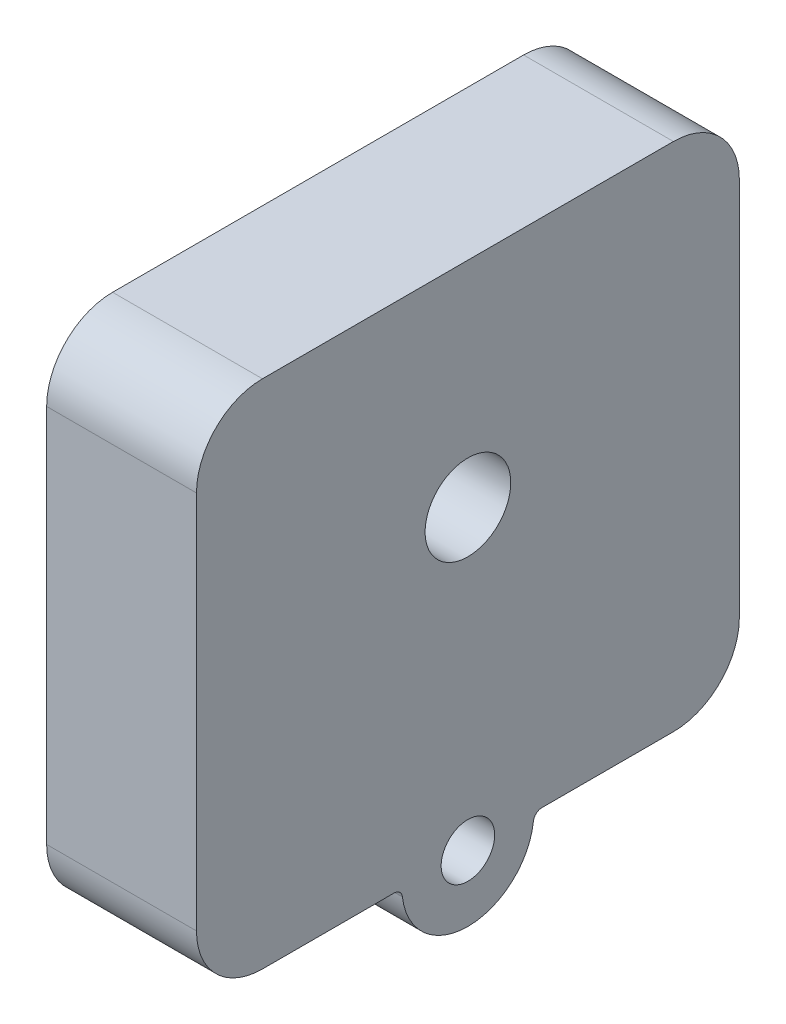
ISO-10303-21;
HEADER;
FILE_DESCRIPTION(('STEP AP214'),'2;1');
FILE_NAME('part.step','',(''),(''),'','','');
FILE_SCHEMA(('AUTOMOTIVE_DESIGN { 1 0 10303 214 1 1 1 1 }'));
ENDSEC;
DATA;
#1=APPLICATION_CONTEXT('core data for automotive mechanical design processes');
#2=APPLICATION_PROTOCOL_DEFINITION('international standard','automotive_design',2000,#1);
#3=PRODUCT_CONTEXT('',#1,'mechanical');
#4=PRODUCT('Part','Part','',(#3));
#5=PRODUCT_RELATED_PRODUCT_CATEGORY('part','',(#4));
#6=PRODUCT_DEFINITION_FORMATION('','',#4);
#7=PRODUCT_DEFINITION_CONTEXT('part definition',#1,'design');
#8=PRODUCT_DEFINITION('design','',#6,#7);
#9=PRODUCT_DEFINITION_SHAPE('','',#8);
#10=(LENGTH_UNIT() NAMED_UNIT(*) SI_UNIT(.MILLI.,.METRE.));
#11=(NAMED_UNIT(*) PLANE_ANGLE_UNIT() SI_UNIT($,.RADIAN.));
#12=(NAMED_UNIT(*) SI_UNIT($,.STERADIAN.) SOLID_ANGLE_UNIT());
#13=UNCERTAINTY_MEASURE_WITH_UNIT(LENGTH_MEASURE(1.E-05),#10,'distance_accuracy_value','');
#14=(GEOMETRIC_REPRESENTATION_CONTEXT(3) GLOBAL_UNCERTAINTY_ASSIGNED_CONTEXT((#13)) GLOBAL_UNIT_ASSIGNED_CONTEXT((#10,
#11,#12)) REPRESENTATION_CONTEXT('',''));
#15=CARTESIAN_POINT('',(0.,0.,0.));
#16=DIRECTION('',(0.,0.,1.));
#17=DIRECTION('',(1.,0.,0.));
#18=AXIS2_PLACEMENT_3D('',#15,#16,#17);
#19=CARTESIAN_POINT('',(0.,-15.6718,4.39030752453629));
#20=DIRECTION('',(1.,0.,0.));
#21=DIRECTION('',(0.,0.,-1.));
#22=AXIS2_PLACEMENT_3D('',#19,#20,#21);
#23=CYLINDRICAL_SURFACE('',#22,0.508);
#24=DIRECTION('',(1.,0.,0.));
#25=VECTOR('',#24,1.);
#26=CARTESIAN_POINT('',(0.,-15.6134091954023,3.88567447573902));
#27=LINE('',#26,#25);
#28=CARTESIAN_POINT('',(8.89,-15.6134091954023,3.88567447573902));
#29=VERTEX_POINT('',#28);
#30=CARTESIAN_POINT('',(0.,-15.6134091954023,3.88567447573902));
#31=VERTEX_POINT('',#30);
#32=EDGE_CURVE('E112',#29,#31,#27,.F.);
#33=ORIENTED_EDGE('',*,*,#32,.F.);
#34=CARTESIAN_POINT('',(8.89,-15.6718,4.39030752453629));
#35=DIRECTION('',(1.,0.,0.));
#36=DIRECTION('',(0.,0.,-1.));
#37=AXIS2_PLACEMENT_3D('',#34,#35,#36);
#38=CIRCLE('',#37,0.508);
#39=CARTESIAN_POINT('',(8.89,-15.1638,4.39030752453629));
#40=VERTEX_POINT('',#39);
#41=EDGE_CURVE('E20',#40,#29,#38,.F.);
#42=ORIENTED_EDGE('',*,*,#41,.F.);
#43=DIRECTION('',(1.,0.,0.));
#44=VECTOR('',#43,1.);
#45=CARTESIAN_POINT('',(0.,-15.1638,4.39030752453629));
#46=LINE('',#45,#44);
#47=CARTESIAN_POINT('',(0.,-15.1638,4.39030752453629));
#48=VERTEX_POINT('',#47);
#49=EDGE_CURVE('E114',#48,#40,#46,.T.);
#50=ORIENTED_EDGE('',*,*,#49,.F.);
#51=CARTESIAN_POINT('',(0.,-15.6718,4.39030752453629));
#52=DIRECTION('',(1.,0.,0.));
#53=DIRECTION('',(0.,0.,-1.));
#54=AXIS2_PLACEMENT_3D('',#51,#52,#53);
#55=CIRCLE('',#54,0.508);
#56=EDGE_CURVE('E109',#48,#31,#55,.F.);
#57=ORIENTED_EDGE('',*,*,#56,.T.);
#58=EDGE_LOOP('',(#33,#42,#50,#57));
#59=FACE_BOUND('',#58,.T.);
#60=ADVANCED_FACE('F17',(#59),#23,.F.);
#61=CARTESIAN_POINT('',(0.,-15.6718,-4.39030752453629));
#62=DIRECTION('',(1.,0.,0.));
#63=DIRECTION('',(0.,0.,-1.));
#64=AXIS2_PLACEMENT_3D('',#61,#62,#63);
#65=CYLINDRICAL_SURFACE('',#64,0.508);
#66=DIRECTION('',(1.,0.,0.));
#67=VECTOR('',#66,1.);
#68=CARTESIAN_POINT('',(0.,-15.1638,-4.39030752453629));
#69=LINE('',#68,#67);
#70=CARTESIAN_POINT('',(8.89,-15.1638,-4.39030752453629));
#71=VERTEX_POINT('',#70);
#72=CARTESIAN_POINT('',(0.,-15.1638,-4.39030752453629));
#73=VERTEX_POINT('',#72);
#74=EDGE_CURVE('E166',#71,#73,#69,.F.);
#75=ORIENTED_EDGE('',*,*,#74,.F.);
#76=CARTESIAN_POINT('',(8.89,-15.6718,-4.39030752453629));
#77=DIRECTION('',(1.,0.,0.));
#78=DIRECTION('',(0.,0.,-1.));
#79=AXIS2_PLACEMENT_3D('',#76,#77,#78);
#80=CIRCLE('',#79,0.508);
#81=CARTESIAN_POINT('',(8.89,-15.6134091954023,-3.88567447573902));
#82=VERTEX_POINT('',#81);
#83=EDGE_CURVE('E34',#82,#71,#80,.F.);
#84=ORIENTED_EDGE('',*,*,#83,.F.);
#85=DIRECTION('',(1.,0.,0.));
#86=VECTOR('',#85,1.);
#87=CARTESIAN_POINT('',(0.,-15.6134091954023,-3.88567447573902));
#88=LINE('',#87,#86);
#89=CARTESIAN_POINT('',(0.,-15.6134091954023,-3.88567447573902));
#90=VERTEX_POINT('',#89);
#91=EDGE_CURVE('E127',#90,#82,#88,.T.);
#92=ORIENTED_EDGE('',*,*,#91,.F.);
#93=CARTESIAN_POINT('',(0.,-15.6718,-4.39030752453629));
#94=DIRECTION('',(1.,0.,0.));
#95=DIRECTION('',(0.,0.,-1.));
#96=AXIS2_PLACEMENT_3D('',#93,#94,#95);
#97=CIRCLE('',#96,0.508);
#98=EDGE_CURVE('E118',#90,#73,#97,.F.);
#99=ORIENTED_EDGE('',*,*,#98,.T.);
#100=EDGE_LOOP('',(#75,#84,#92,#99));
#101=FACE_BOUND('',#100,.T.);
#102=ADVANCED_FACE('F361',(#101),#65,.F.);
#103=CARTESIAN_POINT('',(0.,-0.735734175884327,0.));
#104=DIRECTION('',(1.,0.,0.));
#105=DIRECTION('',(0.,0.,-1.));
#106=AXIS2_PLACEMENT_3D('',#103,#104,#105);
#107=PLANE('',#106);
#108=CARTESIAN_POINT('',(0.,2.4638,0.));
#109=DIRECTION('',(1.,0.,0.));
#110=DIRECTION('',(0.,0.,-1.));
#111=AXIS2_PLACEMENT_3D('',#108,#109,#110);
#112=CIRCLE('',#111,2.54);
#113=CARTESIAN_POINT('',(0.,2.4638,-2.54));
#114=VERTEX_POINT('',#113);
#115=EDGE_CURVE('E198',#114,#114,#112,.T.);
#116=ORIENTED_EDGE('',*,*,#115,.T.);
#117=EDGE_LOOP('',(#116));
#118=FACE_BOUND('',#117,.T.);
#119=CARTESIAN_POINT('',(0.,-15.1638,0.));
#120=DIRECTION('',(1.,0.,0.));
#121=DIRECTION('',(0.,0.,-1.));
#122=AXIS2_PLACEMENT_3D('',#119,#120,#121);
#123=CIRCLE('',#122,1.5875);
#124=CARTESIAN_POINT('',(0.,-15.1638,-1.5875));
#125=VERTEX_POINT('',#124);
#126=EDGE_CURVE('E201',#125,#125,#123,.T.);
#127=ORIENTED_EDGE('',*,*,#126,.T.);
#128=EDGE_LOOP('',(#127));
#129=FACE_BOUND('',#128,.T.);
#130=DIRECTION('',(0.,0.,-1.));
#131=VECTOR('',#130,1.);
#132=CARTESIAN_POINT('',(0.,-15.1638,-10.0076));
#133=LINE('',#132,#131);
#134=CARTESIAN_POINT('',(0.,-15.1638,-12.192));
#135=VERTEX_POINT('',#134);
#136=EDGE_CURVE('E163',#73,#135,#133,.T.);
#137=ORIENTED_EDGE('',*,*,#136,.F.);
#138=ORIENTED_EDGE('',*,*,#98,.F.);
#139=CARTESIAN_POINT('',(0.,-15.1638,0.));
#140=DIRECTION('',(1.,0.,0.));
#141=DIRECTION('',(0.,0.,-1.));
#142=AXIS2_PLACEMENT_3D('',#139,#140,#141);
#143=CIRCLE('',#142,3.9116);
#144=EDGE_CURVE('E121',#31,#90,#143,.T.);
#145=ORIENTED_EDGE('',*,*,#144,.F.);
#146=ORIENTED_EDGE('',*,*,#56,.F.);
#147=DIRECTION('',(0.,0.,-1.));
#148=VECTOR('',#147,1.);
#149=CARTESIAN_POINT('',(0.,-15.1638,10.0076));
#150=LINE('',#149,#148);
#151=CARTESIAN_POINT('',(0.,-15.1638,12.192));
#152=VERTEX_POINT('',#151);
#153=EDGE_CURVE('E130',#152,#48,#150,.T.);
#154=ORIENTED_EDGE('',*,*,#153,.F.);
#155=CARTESIAN_POINT('',(0.,-11.2522,12.192));
#156=DIRECTION('',(1.,0.,0.));
#157=DIRECTION('',(0.,0.,-1.));
#158=AXIS2_PLACEMENT_3D('',#155,#156,#157);
#159=CIRCLE('',#158,3.9116);
#160=CARTESIAN_POINT('',(0.,-11.2522,16.1036));
#161=VERTEX_POINT('',#160);
#162=EDGE_CURVE('E138',#161,#152,#159,.T.);
#163=ORIENTED_EDGE('',*,*,#162,.F.);
#164=DIRECTION('',(0.,1.,0.));
#165=VECTOR('',#164,1.);
#166=CARTESIAN_POINT('',(0.,0.,16.1036));
#167=LINE('',#166,#165);
#168=CARTESIAN_POINT('',(0.,11.2522,16.1036));
#169=VERTEX_POINT('',#168);
#170=EDGE_CURVE('E142',#169,#161,#167,.F.);
#171=ORIENTED_EDGE('',*,*,#170,.F.);
#172=CARTESIAN_POINT('',(0.,11.2522,12.192));
#173=DIRECTION('',(1.,0.,0.));
#174=DIRECTION('',(0.,0.,-1.));
#175=AXIS2_PLACEMENT_3D('',#172,#173,#174);
#176=CIRCLE('',#175,3.9116);
#177=CARTESIAN_POINT('',(0.,15.1638,12.192));
#178=VERTEX_POINT('',#177);
#179=EDGE_CURVE('E146',#178,#169,#176,.T.);
#180=ORIENTED_EDGE('',*,*,#179,.F.);
#181=DIRECTION('',(0.,0.,1.));
#182=VECTOR('',#181,1.);
#183=CARTESIAN_POINT('',(0.,15.1638,0.));
#184=LINE('',#183,#182);
#185=CARTESIAN_POINT('',(0.,15.1638,-12.192));
#186=VERTEX_POINT('',#185);
#187=EDGE_CURVE('E150',#186,#178,#184,.T.);
#188=ORIENTED_EDGE('',*,*,#187,.F.);
#189=CARTESIAN_POINT('',(0.,11.2522,-12.192));
#190=DIRECTION('',(1.,0.,0.));
#191=DIRECTION('',(0.,0.,-1.));
#192=AXIS2_PLACEMENT_3D('',#189,#190,#191);
#193=CIRCLE('',#192,3.9116);
#194=CARTESIAN_POINT('',(0.,11.2522,-16.1036));
#195=VERTEX_POINT('',#194);
#196=EDGE_CURVE('E154',#195,#186,#193,.T.);
#197=ORIENTED_EDGE('',*,*,#196,.F.);
#198=DIRECTION('',(0.,1.,0.));
#199=VECTOR('',#198,1.);
#200=CARTESIAN_POINT('',(0.,0.,-16.1036));
#201=LINE('',#200,#199);
#202=CARTESIAN_POINT('',(0.,-11.2522,-16.1036));
#203=VERTEX_POINT('',#202);
#204=EDGE_CURVE('E158',#203,#195,#201,.T.);
#205=ORIENTED_EDGE('',*,*,#204,.F.);
#206=CARTESIAN_POINT('',(0.,-11.2522,-12.192));
#207=DIRECTION('',(1.,0.,0.));
#208=DIRECTION('',(0.,0.,-1.));
#209=AXIS2_PLACEMENT_3D('',#206,#207,#208);
#210=CIRCLE('',#209,3.9116);
#211=EDGE_CURVE('E162',#135,#203,#210,.T.);
#212=ORIENTED_EDGE('',*,*,#211,.F.);
#213=EDGE_LOOP('',(#137,#138,#145,#146,#154,#163,#171,#180,#188,#197,#205,#212));
#214=FACE_BOUND('',#213,.T.);
#215=ADVANCED_FACE('F123',(#118,#129,#214),#107,.F.);
#216=CARTESIAN_POINT('',(0.,-15.1638,0.));
#217=DIRECTION('',(1.,0.,0.));
#218=DIRECTION('',(0.,0.,-1.));
#219=AXIS2_PLACEMENT_3D('',#216,#217,#218);
#220=CYLINDRICAL_SURFACE('',#219,1.5875);
#221=ORIENTED_EDGE('',*,*,#126,.F.);
#222=EDGE_LOOP('',(#221));
#223=FACE_BOUND('',#222,.T.);
#224=CARTESIAN_POINT('',(8.89,-15.1638,0.));
#225=DIRECTION('',(1.,0.,0.));
#226=DIRECTION('',(0.,0.,-1.));
#227=AXIS2_PLACEMENT_3D('',#224,#225,#226);
#228=CIRCLE('',#227,1.5875);
#229=CARTESIAN_POINT('',(8.89,-15.1638,-1.5875));
#230=VERTEX_POINT('',#229);
#231=EDGE_CURVE('E191',#230,#230,#228,.F.);
#232=ORIENTED_EDGE('',*,*,#231,.F.);
#233=EDGE_LOOP('',(#232));
#234=FACE_BOUND('',#233,.T.);
#235=ADVANCED_FACE('F344',(#223,#234),#220,.F.);
#236=CARTESIAN_POINT('',(0.,2.4638,0.));
#237=DIRECTION('',(1.,0.,0.));
#238=DIRECTION('',(0.,0.,-1.));
#239=AXIS2_PLACEMENT_3D('',#236,#237,#238);
#240=CYLINDRICAL_SURFACE('',#239,2.54);
#241=ORIENTED_EDGE('',*,*,#115,.F.);
#242=EDGE_LOOP('',(#241));
#243=FACE_BOUND('',#242,.T.);
#244=CARTESIAN_POINT('',(8.89,2.4638,0.));
#245=DIRECTION('',(1.,0.,0.));
#246=DIRECTION('',(0.,0.,-1.));
#247=AXIS2_PLACEMENT_3D('',#244,#245,#246);
#248=CIRCLE('',#247,2.54);
#249=CARTESIAN_POINT('',(8.89,2.4638,-2.54));
#250=VERTEX_POINT('',#249);
#251=EDGE_CURVE('E188',#250,#250,#248,.F.);
#252=ORIENTED_EDGE('',*,*,#251,.F.);
#253=EDGE_LOOP('',(#252));
#254=FACE_BOUND('',#253,.T.);
#255=ADVANCED_FACE('F336',(#243,#254),#240,.F.);
#256=CARTESIAN_POINT('',(0.,-11.2522,-12.192));
#257=DIRECTION('',(1.,0.,0.));
#258=DIRECTION('',(0.,0.,-1.));
#259=AXIS2_PLACEMENT_3D('',#256,#257,#258);
#260=CYLINDRICAL_SURFACE('',#259,3.9116);
#261=ORIENTED_EDGE('',*,*,#211,.T.);
#262=DIRECTION('',(-1.,0.,0.));
#263=VECTOR('',#262,1.);
#264=CARTESIAN_POINT('',(0.,-11.2522,-16.1036));
#265=LINE('',#264,#263);
#266=CARTESIAN_POINT('',(8.89,-11.2522,-16.1036));
#267=VERTEX_POINT('',#266);
#268=EDGE_CURVE('E159',#267,#203,#265,.T.);
#269=ORIENTED_EDGE('',*,*,#268,.F.);
#270=CARTESIAN_POINT('',(8.89,-11.2522,-12.192));
#271=DIRECTION('',(1.,0.,0.));
#272=DIRECTION('',(0.,0.,-1.));
#273=AXIS2_PLACEMENT_3D('',#270,#271,#272);
#274=CIRCLE('',#273,3.9116);
#275=CARTESIAN_POINT('',(8.89,-15.1638,-12.192));
#276=VERTEX_POINT('',#275);
#277=EDGE_CURVE('E185',#276,#267,#274,.T.);
#278=ORIENTED_EDGE('',*,*,#277,.F.);
#279=DIRECTION('',(1.,0.,0.));
#280=VECTOR('',#279,1.);
#281=CARTESIAN_POINT('',(0.,-15.1638,-12.192));
#282=LINE('',#281,#280);
#283=EDGE_CURVE('E165',#135,#276,#282,.T.);
#284=ORIENTED_EDGE('',*,*,#283,.F.);
#285=EDGE_LOOP('',(#261,#269,#278,#284));
#286=FACE_BOUND('',#285,.T.);
#287=ADVANCED_FACE('F224',(#286),#260,.T.);
#288=CARTESIAN_POINT('',(0.,0.,-16.1036));
#289=DIRECTION('',(0.,0.,-1.));
#290=DIRECTION('',(-1.,0.,0.));
#291=AXIS2_PLACEMENT_3D('',#288,#289,#290);
#292=PLANE('',#291);
#293=DIRECTION('',(1.,0.,0.));
#294=VECTOR('',#293,1.);
#295=CARTESIAN_POINT('',(0.,11.2522,-16.1036));
#296=LINE('',#295,#294);
#297=CARTESIAN_POINT('',(8.89,11.2522,-16.1036));
#298=VERTEX_POINT('',#297);
#299=EDGE_CURVE('E155',#298,#195,#296,.F.);
#300=ORIENTED_EDGE('',*,*,#299,.F.);
#301=DIRECTION('',(0.,1.,0.));
#302=VECTOR('',#301,1.);
#303=CARTESIAN_POINT('',(8.89,-0.735734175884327,-16.1036));
#304=LINE('',#303,#302);
#305=EDGE_CURVE('E184',#267,#298,#304,.T.);
#306=ORIENTED_EDGE('',*,*,#305,.F.);
#307=ORIENTED_EDGE('',*,*,#268,.T.);
#308=ORIENTED_EDGE('',*,*,#204,.T.);
#309=EDGE_LOOP('',(#300,#306,#307,#308));
#310=FACE_BOUND('',#309,.T.);
#311=ADVANCED_FACE('F227',(#310),#292,.T.);
#312=CARTESIAN_POINT('',(0.,11.2522,-12.192));
#313=DIRECTION('',(1.,0.,0.));
#314=DIRECTION('',(0.,0.,-1.));
#315=AXIS2_PLACEMENT_3D('',#312,#313,#314);
#316=CYLINDRICAL_SURFACE('',#315,3.9116);
#317=ORIENTED_EDGE('',*,*,#196,.T.);
#318=DIRECTION('',(1.,0.,0.));
#319=VECTOR('',#318,1.);
#320=CARTESIAN_POINT('',(0.,15.1638,-12.192));
#321=LINE('',#320,#319);
#322=CARTESIAN_POINT('',(8.89,15.1638,-12.192));
#323=VERTEX_POINT('',#322);
#324=EDGE_CURVE('E151',#323,#186,#321,.F.);
#325=ORIENTED_EDGE('',*,*,#324,.F.);
#326=CARTESIAN_POINT('',(8.89,11.2522,-12.192));
#327=DIRECTION('',(1.,0.,0.));
#328=DIRECTION('',(0.,0.,-1.));
#329=AXIS2_PLACEMENT_3D('',#326,#327,#328);
#330=CIRCLE('',#329,3.9116);
#331=EDGE_CURVE('E181',#298,#323,#330,.T.);
#332=ORIENTED_EDGE('',*,*,#331,.F.);
#333=ORIENTED_EDGE('',*,*,#299,.T.);
#334=EDGE_LOOP('',(#317,#325,#332,#333));
#335=FACE_BOUND('',#334,.T.);
#336=ADVANCED_FACE('F231',(#335),#316,.T.);
#337=CARTESIAN_POINT('',(0.,15.1638,0.));
#338=DIRECTION('',(0.,1.,0.));
#339=DIRECTION('',(0.,0.,1.));
#340=AXIS2_PLACEMENT_3D('',#337,#338,#339);
#341=PLANE('',#340);
#342=DIRECTION('',(1.,0.,0.));
#343=VECTOR('',#342,1.);
#344=CARTESIAN_POINT('',(0.,15.1638,12.192));
#345=LINE('',#344,#343);
#346=CARTESIAN_POINT('',(8.89,15.1638,12.192));
#347=VERTEX_POINT('',#346);
#348=EDGE_CURVE('E147',#347,#178,#345,.F.);
#349=ORIENTED_EDGE('',*,*,#348,.F.);
#350=DIRECTION('',(0.,0.,-1.));
#351=VECTOR('',#350,1.);
#352=CARTESIAN_POINT('',(8.89,15.1638,0.));
#353=LINE('',#352,#351);
#354=EDGE_CURVE('E180',#323,#347,#353,.F.);
#355=ORIENTED_EDGE('',*,*,#354,.F.);
#356=ORIENTED_EDGE('',*,*,#324,.T.);
#357=ORIENTED_EDGE('',*,*,#187,.T.);
#358=EDGE_LOOP('',(#349,#355,#356,#357));
#359=FACE_BOUND('',#358,.T.);
#360=ADVANCED_FACE('F235',(#359),#341,.T.);
#361=CARTESIAN_POINT('',(0.,11.2522,12.192));
#362=DIRECTION('',(1.,0.,0.));
#363=DIRECTION('',(0.,0.,-1.));
#364=AXIS2_PLACEMENT_3D('',#361,#362,#363);
#365=CYLINDRICAL_SURFACE('',#364,3.9116);
#366=ORIENTED_EDGE('',*,*,#179,.T.);
#367=DIRECTION('',(1.,0.,0.));
#368=VECTOR('',#367,1.);
#369=CARTESIAN_POINT('',(0.,11.2522,16.1036));
#370=LINE('',#369,#368);
#371=CARTESIAN_POINT('',(8.89,11.2522,16.1036));
#372=VERTEX_POINT('',#371);
#373=EDGE_CURVE('E143',#372,#169,#370,.F.);
#374=ORIENTED_EDGE('',*,*,#373,.F.);
#375=CARTESIAN_POINT('',(8.89,11.2522,12.192));
#376=DIRECTION('',(1.,0.,0.));
#377=DIRECTION('',(0.,0.,-1.));
#378=AXIS2_PLACEMENT_3D('',#375,#376,#377);
#379=CIRCLE('',#378,3.9116);
#380=EDGE_CURVE('E177',#347,#372,#379,.T.);
#381=ORIENTED_EDGE('',*,*,#380,.F.);
#382=ORIENTED_EDGE('',*,*,#348,.T.);
#383=EDGE_LOOP('',(#366,#374,#381,#382));
#384=FACE_BOUND('',#383,.T.);
#385=ADVANCED_FACE('F239',(#384),#365,.T.);
#386=CARTESIAN_POINT('',(0.,0.,16.1036));
#387=DIRECTION('',(0.,0.,1.));
#388=DIRECTION('',(1.,0.,0.));
#389=AXIS2_PLACEMENT_3D('',#386,#387,#388);
#390=PLANE('',#389);
#391=ORIENTED_EDGE('',*,*,#373,.T.);
#392=ORIENTED_EDGE('',*,*,#170,.T.);
#393=DIRECTION('',(1.,0.,0.));
#394=VECTOR('',#393,1.);
#395=CARTESIAN_POINT('',(0.,-11.2522,16.1036));
#396=LINE('',#395,#394);
#397=CARTESIAN_POINT('',(8.89,-11.2522,16.1036));
#398=VERTEX_POINT('',#397);
#399=EDGE_CURVE('E139',#398,#161,#396,.F.);
#400=ORIENTED_EDGE('',*,*,#399,.F.);
#401=DIRECTION('',(0.,1.,0.));
#402=VECTOR('',#401,1.);
#403=CARTESIAN_POINT('',(8.89,-0.735734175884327,16.1036));
#404=LINE('',#403,#402);
#405=EDGE_CURVE('E176',#372,#398,#404,.F.);
#406=ORIENTED_EDGE('',*,*,#405,.F.);
#407=EDGE_LOOP('',(#391,#392,#400,#406));
#408=FACE_BOUND('',#407,.T.);
#409=ADVANCED_FACE('F243',(#408),#390,.T.);
#410=CARTESIAN_POINT('',(0.,-11.2522,12.192));
#411=DIRECTION('',(1.,0.,0.));
#412=DIRECTION('',(0.,0.,-1.));
#413=AXIS2_PLACEMENT_3D('',#410,#411,#412);
#414=CYLINDRICAL_SURFACE('',#413,3.9116);
#415=ORIENTED_EDGE('',*,*,#162,.T.);
#416=DIRECTION('',(1.,0.,0.));
#417=VECTOR('',#416,1.);
#418=CARTESIAN_POINT('',(0.,-15.1638,12.192));
#419=LINE('',#418,#417);
#420=CARTESIAN_POINT('',(8.89,-15.1638,12.192));
#421=VERTEX_POINT('',#420);
#422=EDGE_CURVE('E53',#421,#152,#419,.F.);
#423=ORIENTED_EDGE('',*,*,#422,.F.);
#424=CARTESIAN_POINT('',(8.89,-11.2522,12.192));
#425=DIRECTION('',(1.,0.,0.));
#426=DIRECTION('',(0.,0.,-1.));
#427=AXIS2_PLACEMENT_3D('',#424,#425,#426);
#428=CIRCLE('',#427,3.9116);
#429=EDGE_CURVE('E173',#398,#421,#428,.T.);
#430=ORIENTED_EDGE('',*,*,#429,.F.);
#431=ORIENTED_EDGE('',*,*,#399,.T.);
#432=EDGE_LOOP('',(#415,#423,#430,#431));
#433=FACE_BOUND('',#432,.T.);
#434=ADVANCED_FACE('F245',(#433),#414,.T.);
#435=CARTESIAN_POINT('',(0.,-15.1638,10.0076));
#436=DIRECTION('',(0.,-1.,0.));
#437=DIRECTION('',(0.,0.,-1.));
#438=AXIS2_PLACEMENT_3D('',#435,#436,#437);
#439=PLANE('',#438);
#440=ORIENTED_EDGE('',*,*,#422,.T.);
#441=ORIENTED_EDGE('',*,*,#153,.T.);
#442=ORIENTED_EDGE('',*,*,#49,.T.);
#443=DIRECTION('',(0.,0.,-1.));
#444=VECTOR('',#443,1.);
#445=CARTESIAN_POINT('',(8.89,-15.1638,0.));
#446=LINE('',#445,#444);
#447=EDGE_CURVE('E172',#421,#40,#446,.T.);
#448=ORIENTED_EDGE('',*,*,#447,.F.);
#449=EDGE_LOOP('',(#440,#441,#442,#448));
#450=FACE_BOUND('',#449,.T.);
#451=ADVANCED_FACE('F247',(#450),#439,.T.);
#452=CARTESIAN_POINT('',(0.,-15.1638,0.));
#453=DIRECTION('',(1.,0.,0.));
#454=DIRECTION('',(0.,0.,-1.));
#455=AXIS2_PLACEMENT_3D('',#452,#453,#454);
#456=CYLINDRICAL_SURFACE('',#455,3.9116);
#457=ORIENTED_EDGE('',*,*,#91,.T.);
#458=CARTESIAN_POINT('',(8.89,-15.1638,0.));
#459=DIRECTION('',(1.,0.,0.));
#460=DIRECTION('',(0.,0.,-1.));
#461=AXIS2_PLACEMENT_3D('',#458,#459,#460);
#462=CIRCLE('',#461,3.9116);
#463=EDGE_CURVE('E26',#29,#82,#462,.T.);
#464=ORIENTED_EDGE('',*,*,#463,.F.);
#465=ORIENTED_EDGE('',*,*,#32,.T.);
#466=ORIENTED_EDGE('',*,*,#144,.T.);
#467=EDGE_LOOP('',(#457,#464,#465,#466));
#468=FACE_BOUND('',#467,.T.);
#469=ADVANCED_FACE('F129',(#468),#456,.T.);
#470=CARTESIAN_POINT('',(0.,-15.1638,-10.0076));
#471=DIRECTION('',(0.,-1.,0.));
#472=DIRECTION('',(0.,0.,-1.));
#473=AXIS2_PLACEMENT_3D('',#470,#471,#472);
#474=PLANE('',#473);
#475=ORIENTED_EDGE('',*,*,#283,.T.);
#476=DIRECTION('',(0.,0.,-1.));
#477=VECTOR('',#476,1.);
#478=CARTESIAN_POINT('',(8.89,-15.1638,0.));
#479=LINE('',#478,#477);
#480=EDGE_CURVE('E11',#71,#276,#479,.T.);
#481=ORIENTED_EDGE('',*,*,#480,.F.);
#482=ORIENTED_EDGE('',*,*,#74,.T.);
#483=ORIENTED_EDGE('',*,*,#136,.T.);
#484=EDGE_LOOP('',(#475,#481,#482,#483));
#485=FACE_BOUND('',#484,.T.);
#486=ADVANCED_FACE('F221',(#485),#474,.T.);
#487=CARTESIAN_POINT('',(8.89,-0.735734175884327,0.));
#488=DIRECTION('',(1.,0.,0.));
#489=DIRECTION('',(0.,0.,-1.));
#490=AXIS2_PLACEMENT_3D('',#487,#488,#489);
#491=PLANE('',#490);
#492=ORIENTED_EDGE('',*,*,#83,.T.);
#493=ORIENTED_EDGE('',*,*,#480,.T.);
#494=ORIENTED_EDGE('',*,*,#277,.T.);
#495=ORIENTED_EDGE('',*,*,#305,.T.);
#496=ORIENTED_EDGE('',*,*,#331,.T.);
#497=ORIENTED_EDGE('',*,*,#354,.T.);
#498=ORIENTED_EDGE('',*,*,#380,.T.);
#499=ORIENTED_EDGE('',*,*,#405,.T.);
#500=ORIENTED_EDGE('',*,*,#429,.T.);
#501=ORIENTED_EDGE('',*,*,#447,.T.);
#502=ORIENTED_EDGE('',*,*,#41,.T.);
#503=ORIENTED_EDGE('',*,*,#463,.T.);
#504=EDGE_LOOP('',(#492,#493,#494,#495,#496,#497,#498,#499,#500,#501,#502,#503));
#505=FACE_BOUND('',#504,.T.);
#506=ORIENTED_EDGE('',*,*,#251,.T.);
#507=EDGE_LOOP('',(#506));
#508=FACE_BOUND('',#507,.T.);
#509=ORIENTED_EDGE('',*,*,#231,.T.);
#510=EDGE_LOOP('',(#509));
#511=FACE_BOUND('',#510,.T.);
#512=ADVANCED_FACE('F205',(#505,#508,#511),#491,.T.);
#513=CLOSED_SHELL('',(#60,#102,#215,#235,#255,#287,#311,#336,#360,#385,#409,#434,#451,#469,#486,#512));
#514=MANIFOLD_SOLID_BREP('B1',#513);
#515=ADVANCED_BREP_SHAPE_REPRESENTATION('',(#18,#514),#14);
#516=SHAPE_DEFINITION_REPRESENTATION(#9,#515);
ENDSEC;
END-ISO-10303-21;
